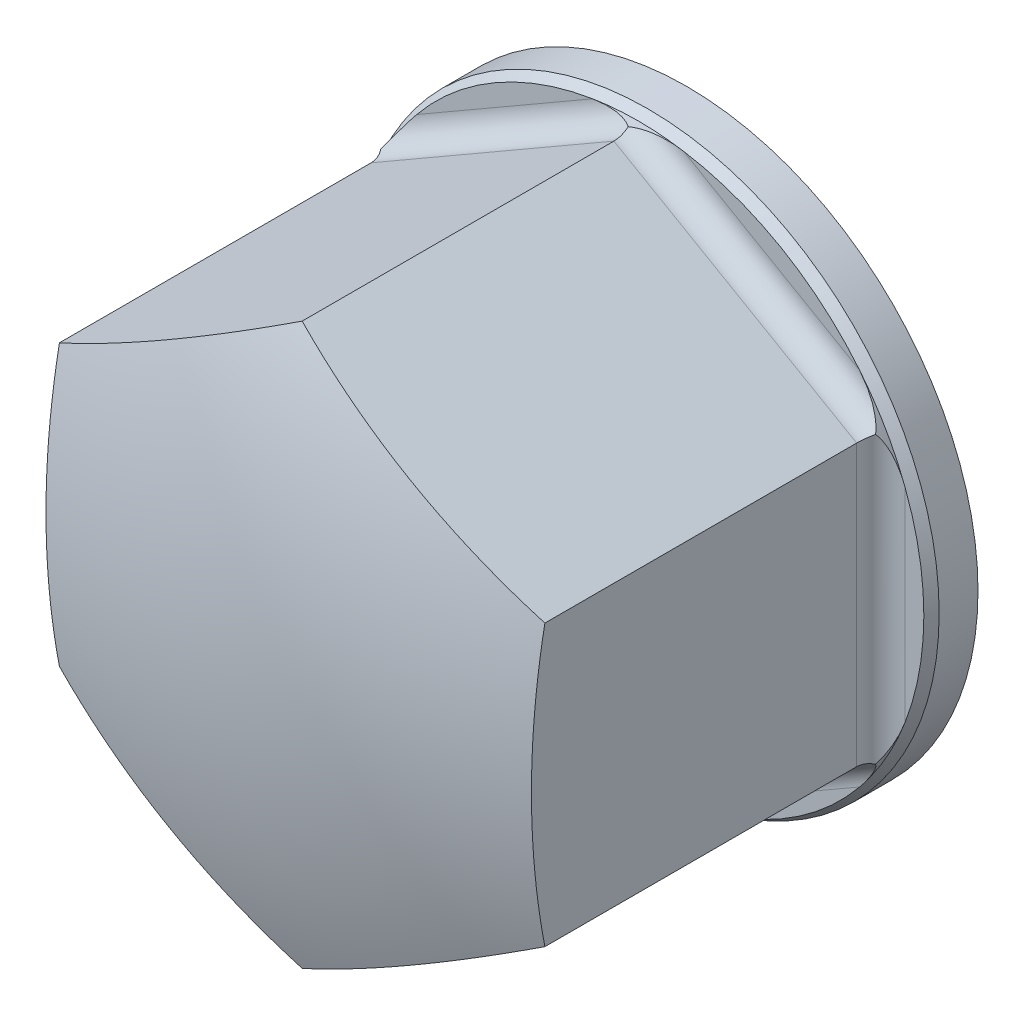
ISO-10303-21;
HEADER;
FILE_DESCRIPTION(('STEP AP214'),'2;1');
FILE_NAME('part.step','',(''),(''),'','','');
FILE_SCHEMA(('AUTOMOTIVE_DESIGN { 1 0 10303 214 1 1 1 1 }'));
ENDSEC;
DATA;
#1=APPLICATION_CONTEXT('core data for automotive mechanical design processes');
#2=APPLICATION_PROTOCOL_DEFINITION('international standard','automotive_design',2000,#1);
#3=PRODUCT_CONTEXT('',#1,'mechanical');
#4=PRODUCT('Part','Part','',(#3));
#5=PRODUCT_RELATED_PRODUCT_CATEGORY('part','',(#4));
#6=PRODUCT_DEFINITION_FORMATION('','',#4);
#7=PRODUCT_DEFINITION_CONTEXT('part definition',#1,'design');
#8=PRODUCT_DEFINITION('design','',#6,#7);
#9=PRODUCT_DEFINITION_SHAPE('','',#8);
#10=(LENGTH_UNIT() NAMED_UNIT(*) SI_UNIT(.MILLI.,.METRE.));
#11=(NAMED_UNIT(*) PLANE_ANGLE_UNIT() SI_UNIT($,.RADIAN.));
#12=(NAMED_UNIT(*) SI_UNIT($,.STERADIAN.) SOLID_ANGLE_UNIT());
#13=UNCERTAINTY_MEASURE_WITH_UNIT(LENGTH_MEASURE(1.E-05),#10,'distance_accuracy_value','');
#14=(GEOMETRIC_REPRESENTATION_CONTEXT(3) GLOBAL_UNCERTAINTY_ASSIGNED_CONTEXT((#13)) GLOBAL_UNIT_ASSIGNED_CONTEXT((#10,
#11,#12)) REPRESENTATION_CONTEXT('',''));
#15=CARTESIAN_POINT('',(0.,0.,0.));
#16=DIRECTION('',(0.,0.,1.));
#17=DIRECTION('',(1.,0.,0.));
#18=AXIS2_PLACEMENT_3D('',#15,#16,#17);
#19=CARTESIAN_POINT('',(0.,0.,0.));
#20=DIRECTION('',(0.,0.,-1.));
#21=DIRECTION('',(1.,0.,0.));
#22=AXIS2_PLACEMENT_3D('',#19,#20,#21);
#23=CYLINDRICAL_SURFACE('',#22,6.);
#24=CARTESIAN_POINT('',(0.,0.,0.));
#25=DIRECTION('',(0.,0.,-1.));
#26=DIRECTION('',(1.,0.,0.));
#27=AXIS2_PLACEMENT_3D('',#24,#25,#26);
#28=CIRCLE('',#27,6.);
#29=CARTESIAN_POINT('',(6.00000000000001,0.,0.));
#30=VERTEX_POINT('',#29);
#31=EDGE_CURVE('E177',#30,#30,#28,.T.);
#32=ORIENTED_EDGE('',*,*,#31,.F.);
#33=EDGE_LOOP('',(#32));
#34=FACE_BOUND('',#33,.T.);
#35=CARTESIAN_POINT('',(0.,0.,0.8));
#36=DIRECTION('',(0.,0.,-1.));
#37=DIRECTION('',(0.,1.,0.));
#38=AXIS2_PLACEMENT_3D('',#35,#36,#37);
#39=CIRCLE('',#38,6.);
#40=CARTESIAN_POINT('',(0.,6.,0.8));
#41=VERTEX_POINT('',#40);
#42=EDGE_CURVE('E138',#41,#41,#39,.T.);
#43=ORIENTED_EDGE('',*,*,#42,.T.);
#44=EDGE_LOOP('',(#43));
#45=FACE_BOUND('',#44,.T.);
#46=ADVANCED_FACE('F14',(#34,#45),#23,.T.);
#47=CARTESIAN_POINT('',(6.,0.,0.));
#48=DIRECTION('',(0.,0.,1.));
#49=DIRECTION('',(-1.,0.,0.));
#50=AXIS2_PLACEMENT_3D('',#47,#48,#49);
#51=PLANE('',#50);
#52=CARTESIAN_POINT('',(0.,0.,0.));
#53=DIRECTION('',(0.,0.,-1.));
#54=DIRECTION('',(1.,0.,0.));
#55=AXIS2_PLACEMENT_3D('',#52,#53,#54);
#56=CIRCLE('',#55,3.);
#57=CARTESIAN_POINT('',(3.00000000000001,0.,0.));
#58=VERTEX_POINT('',#57);
#59=EDGE_CURVE('E333',#58,#58,#56,.T.);
#60=ORIENTED_EDGE('',*,*,#59,.F.);
#61=EDGE_LOOP('',(#60));
#62=FACE_BOUND('',#61,.T.);
#63=ORIENTED_EDGE('',*,*,#31,.T.);
#64=EDGE_LOOP('',(#63));
#65=FACE_BOUND('',#64,.T.);
#66=ADVANCED_FACE('F317',(#62,#65),#51,.F.);
#67=CARTESIAN_POINT('',(0.,0.,0.8));
#68=DIRECTION('',(0.,0.,-1.));
#69=DIRECTION('',(0.,1.,0.));
#70=AXIS2_PLACEMENT_3D('',#67,#68,#69);
#71=CYLINDRICAL_SURFACE('',#70,5.88452994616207);
#72=CARTESIAN_POINT('',(-5.0408726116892,-3.036,1.30200494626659));
#73=CARTESIAN_POINT('',(-5.04670550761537,-3.02631681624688,1.28849453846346));
#74=CARTESIAN_POINT('',(-5.05292061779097,-3.01593273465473,1.27570518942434));
#75=CARTESIAN_POINT('',(-5.06590787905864,-2.99406565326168,1.25149804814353));
#76=CARTESIAN_POINT('',(-5.072678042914,-2.98258655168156,1.24007569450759));
#77=CARTESIAN_POINT('',(-5.09333845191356,-2.94725773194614,1.20799355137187));
#78=CARTESIAN_POINT('',(-5.10779048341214,-2.92216747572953,1.18906620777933));
#79=CARTESIAN_POINT('',(-5.13464017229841,-2.87467756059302,1.1581659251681));
#80=CARTESIAN_POINT('',(-5.14693463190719,-2.85261605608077,1.14555427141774));
#81=CARTESIAN_POINT('',(-5.17169935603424,-2.80746904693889,1.12250286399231));
#82=CARTESIAN_POINT('',(-5.18416971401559,-2.784382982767,1.11206431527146));
#83=CARTESIAN_POINT('',(-5.22196958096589,-2.71323254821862,1.08320089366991));
#84=CARTESIAN_POINT('',(-5.24728112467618,-2.66399076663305,1.06765920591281));
#85=CARTESIAN_POINT('',(-5.29328138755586,-2.57121479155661,1.04411992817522));
#86=CARTESIAN_POINT('',(-5.31409652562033,-2.52792473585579,1.03534287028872));
#87=CARTESIAN_POINT('',(-5.3548722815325,-2.44036222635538,1.02103731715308));
#88=CARTESIAN_POINT('',(-5.37483196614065,-2.39608877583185,1.01551229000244));
#89=CARTESIAN_POINT('',(-5.41289974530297,-2.30876185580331,1.00727593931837));
#90=CARTESIAN_POINT('',(-5.43105048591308,-2.26573659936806,1.00445492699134));
#91=CARTESIAN_POINT('',(-5.46630824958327,-2.17929920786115,1.00082662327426));
#92=CARTESIAN_POINT('',(-5.48341777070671,-2.13588831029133,1.00001431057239));
#93=CARTESIAN_POINT('',(-5.5,-2.0922936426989,1.));
#94=B_SPLINE_CURVE_WITH_KNOTS('',3,(#72,#73,#74,#75,#76,#77,#78,#79,#80,#81,#82,#83,#84,#85,#86,
#87,#88,#89,#90,#91,#92,#93),.UNSPECIFIED.,.F.,.F.,(4,2,2,2,2,2,2,2,2,2,4),(0.,
0.052752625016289,0.105324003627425,0.208666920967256,0.293253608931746,0.377887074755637,
0.549910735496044,0.696276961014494,0.842798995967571,0.983088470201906,1.12302689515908),.UNSPECIFIED.);
#95=CARTESIAN_POINT('',(-5.09615242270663,-2.94226497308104,1.20519984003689));
#96=VERTEX_POINT('',#95);
#97=CARTESIAN_POINT('',(-5.5,-2.0922936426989,1.));
#98=VERTEX_POINT('',#97);
#99=EDGE_CURVE('E272',#96,#98,#94,.T.);
#100=ORIENTED_EDGE('',*,*,#99,.T.);
#101=CARTESIAN_POINT('',(0.,0.,1.));
#102=DIRECTION('',(0.,0.,-1.));
#103=DIRECTION('',(0.,1.,0.));
#104=AXIS2_PLACEMENT_3D('',#101,#102,#103);
#105=CIRCLE('',#104,5.88452994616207);
#106=CARTESIAN_POINT('',(-4.56197944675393,-3.71699289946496,1.));
#107=VERTEX_POINT('',#106);
#108=EDGE_CURVE('E574',#107,#98,#105,.T.);
#109=ORIENTED_EDGE('',*,*,#108,.F.);
#110=CARTESIAN_POINT('',(-4.56197944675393,-3.71699289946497,1.));
#111=CARTESIAN_POINT('',(-4.59415609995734,-3.67750631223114,1.00002128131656));
#112=CARTESIAN_POINT('',(-4.62583189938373,-3.63757788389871,1.0009866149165));
#113=CARTESIAN_POINT('',(-4.68819152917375,-3.55684622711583,1.00535418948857));
#114=CARTESIAN_POINT('',(-4.71887111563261,-3.51604024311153,1.00876571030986));
#115=CARTESIAN_POINT('',(-4.78026933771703,-3.43213261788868,1.01878968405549));
#116=CARTESIAN_POINT('',(-4.81093501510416,-3.38900675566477,1.02553110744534));
#117=CARTESIAN_POINT('',(-4.87067859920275,-3.3025647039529,1.04311775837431));
#118=CARTESIAN_POINT('',(-4.89975911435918,-3.25924896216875,1.05395599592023));
#119=CARTESIAN_POINT('',(-4.95206170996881,-3.17910874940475,1.07903562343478));
#120=CARTESIAN_POINT('',(-4.97553073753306,-3.14223246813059,1.09257910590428));
#121=CARTESIAN_POINT('',(-5.02041285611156,-3.07000407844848,1.124462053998));
#122=CARTESIAN_POINT('',(-5.04184914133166,-3.03463822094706,1.14273533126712));
#123=CARTESIAN_POINT('',(-5.0787570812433,-2.97237024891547,1.18187052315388));
#124=CARTESIAN_POINT('',(-5.09461362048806,-2.94507622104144,1.20170581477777));
#125=CARTESIAN_POINT('',(-5.11672737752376,-2.90637598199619,1.23567469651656));
#126=CARTESIAN_POINT('',(-5.12387456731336,-2.89374999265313,1.24782456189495));
#127=CARTESIAN_POINT('',(-5.13740684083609,-2.86965825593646,1.27370075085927));
#128=CARTESIAN_POINT('',(-5.14378884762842,-2.85819721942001,1.28743303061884));
#129=CARTESIAN_POINT('',(-5.14968943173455,-2.8475237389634,1.30200494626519));
#130=B_SPLINE_CURVE_WITH_KNOTS('',3,(#110,#111,#112,#113,#114,#115,#116,#117,#118,#119,#120,
#121,#122,#123,#124,#125,#126,#127,#128,#129),.UNSPECIFIED.,.F.,.F.,(4,2,2,2,2,2,2,2,2,4),(0.,
0.152836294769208,0.306255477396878,0.466147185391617,0.625767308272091,0.762817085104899,
0.898043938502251,1.0093961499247,1.06606352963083,1.12295163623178),.UNSPECIFIED.);
#131=EDGE_CURVE('E267',#107,#96,#130,.T.);
#132=ORIENTED_EDGE('',*,*,#131,.T.);
#133=EDGE_LOOP('',(#100,#109,#132));
#134=FACE_BOUND('',#133,.T.);
#135=ADVANCED_FACE('F202',(#134),#71,.T.);
#136=CARTESIAN_POINT('',(5.04087261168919,3.036,1.30200494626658));
#137=CARTESIAN_POINT('',(5.04670550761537,3.02631681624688,1.28849453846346));
#138=CARTESIAN_POINT('',(5.05292061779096,3.01593273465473,1.27570518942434));
#139=CARTESIAN_POINT('',(5.06590787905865,2.99406565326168,1.25149804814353));
#140=CARTESIAN_POINT('',(5.072678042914,2.98258655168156,1.24007569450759));
#141=CARTESIAN_POINT('',(5.09333845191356,2.94725773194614,1.20799355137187));
#142=CARTESIAN_POINT('',(5.10779048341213,2.92216747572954,1.18906620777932));
#143=CARTESIAN_POINT('',(5.1346401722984,2.87467756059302,1.1581659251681));
#144=CARTESIAN_POINT('',(5.14693463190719,2.85261605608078,1.14555427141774));
#145=CARTESIAN_POINT('',(5.17169935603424,2.80746904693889,1.12250286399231));
#146=CARTESIAN_POINT('',(5.18416971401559,2.784382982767,1.11206431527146));
#147=CARTESIAN_POINT('',(5.22196958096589,2.71323254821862,1.08320089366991));
#148=CARTESIAN_POINT('',(5.24728112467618,2.66399076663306,1.0676592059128));
#149=CARTESIAN_POINT('',(5.29328138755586,2.57121479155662,1.04411992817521));
#150=CARTESIAN_POINT('',(5.31409652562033,2.52792473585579,1.03534287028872));
#151=CARTESIAN_POINT('',(5.35487228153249,2.44036222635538,1.02103731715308));
#152=CARTESIAN_POINT('',(5.37483196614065,2.39608877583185,1.01551229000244));
#153=CARTESIAN_POINT('',(5.41289974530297,2.30876185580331,1.00727593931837));
#154=CARTESIAN_POINT('',(5.43105048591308,2.26573659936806,1.00445492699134));
#155=CARTESIAN_POINT('',(5.46630824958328,2.17929920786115,1.00082662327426));
#156=CARTESIAN_POINT('',(5.48341777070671,2.13588831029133,1.00001431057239));
#157=CARTESIAN_POINT('',(5.5,2.0922936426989,1.));
#158=B_SPLINE_CURVE_WITH_KNOTS('',3,(#136,#137,#138,#139,#140,#141,#142,#143,#144,#145,#146,
#147,#148,#149,#150,#151,#152,#153,#154,#155,#156,#157),.UNSPECIFIED.,.F.,.F.,(4,2,2,2,2,2,2,2,
2,2,4),(0.,0.0527526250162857,0.105324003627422,0.208666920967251,0.293253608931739,
0.377887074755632,0.549910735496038,0.696276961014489,0.842798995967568,0.983088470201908,
1.12302689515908),.UNSPECIFIED.);
#159=CARTESIAN_POINT('',(5.09615242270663,2.94226497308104,1.20519984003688));
#160=VERTEX_POINT('',#159);
#161=CARTESIAN_POINT('',(5.5,2.0922936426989,1.));
#162=VERTEX_POINT('',#161);
#163=EDGE_CURVE('E261',#160,#162,#158,.T.);
#164=ORIENTED_EDGE('',*,*,#163,.T.);
#165=CARTESIAN_POINT('',(4.56197944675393,3.71699289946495,1.));
#166=VERTEX_POINT('',#165);
#167=EDGE_CURVE('E134',#166,#162,#105,.T.);
#168=ORIENTED_EDGE('',*,*,#167,.F.);
#169=CARTESIAN_POINT('',(4.56197944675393,3.71699289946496,1.));
#170=CARTESIAN_POINT('',(4.59415609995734,3.67750631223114,1.00002128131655));
#171=CARTESIAN_POINT('',(4.62583189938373,3.63757788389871,1.0009866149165));
#172=CARTESIAN_POINT('',(4.68819152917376,3.55684622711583,1.00535418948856));
#173=CARTESIAN_POINT('',(4.71887111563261,3.51604024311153,1.00876571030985));
#174=CARTESIAN_POINT('',(4.78026933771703,3.43213261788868,1.01878968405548));
#175=CARTESIAN_POINT('',(4.81093501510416,3.38900675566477,1.02553110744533));
#176=CARTESIAN_POINT('',(4.87067859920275,3.3025647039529,1.0431177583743));
#177=CARTESIAN_POINT('',(4.89975911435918,3.25924896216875,1.05395599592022));
#178=CARTESIAN_POINT('',(4.95206170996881,3.17910874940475,1.07903562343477));
#179=CARTESIAN_POINT('',(4.97553073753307,3.14223246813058,1.09257910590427));
#180=CARTESIAN_POINT('',(5.02041285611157,3.07000407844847,1.12446205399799));
#181=CARTESIAN_POINT('',(5.04184914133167,3.03463822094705,1.14273533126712));
#182=CARTESIAN_POINT('',(5.07875708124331,2.97237024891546,1.18187052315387));
#183=CARTESIAN_POINT('',(5.09461362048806,2.94507622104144,1.20170581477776));
#184=CARTESIAN_POINT('',(5.11672737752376,2.90637598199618,1.23567469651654));
#185=CARTESIAN_POINT('',(5.12387456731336,2.89374999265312,1.24782456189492));
#186=CARTESIAN_POINT('',(5.1374068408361,2.86965825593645,1.27370075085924));
#187=CARTESIAN_POINT('',(5.14378884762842,2.85819721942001,1.28743303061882));
#188=CARTESIAN_POINT('',(5.14968943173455,2.8475237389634,1.30200494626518));
#189=B_SPLINE_CURVE_WITH_KNOTS('',3,(#169,#170,#171,#172,#173,#174,#175,#176,#177,#178,#179,
#180,#181,#182,#183,#184,#185,#186,#187,#188),.UNSPECIFIED.,.F.,.F.,(4,2,2,2,2,2,2,2,2,4),(0.,
0.152836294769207,0.306255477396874,0.466147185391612,0.625767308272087,0.762817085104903,
0.898043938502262,1.0093961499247,1.06606352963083,1.12295163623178),.UNSPECIFIED.);
#190=EDGE_CURVE('E255',#166,#160,#189,.T.);
#191=ORIENTED_EDGE('',*,*,#190,.T.);
#192=EDGE_LOOP('',(#164,#168,#191));
#193=FACE_BOUND('',#192,.T.);
#194=ADVANCED_FACE('F484',(#193),#71,.T.);
#195=CARTESIAN_POINT('',(-5.5,2.0922936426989,1.));
#196=CARTESIAN_POINT('',(-5.48189193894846,2.13990273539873,1.00002128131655));
#197=CARTESIAN_POINT('',(-5.46315080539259,2.18729899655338,1.00098661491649));
#198=CARTESIAN_POINT('',(-5.42441495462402,2.28166984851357,1.00535418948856));
#199=CARTESIAN_POINT('',(-5.4044157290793,2.3286421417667,1.00876571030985));
#200=CARTESIAN_POINT('',(-5.3624487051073,2.42376837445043,1.01878968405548));
#201=CARTESIAN_POINT('',(-5.34043345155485,2.47188856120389,1.02553110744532));
#202=CARTESIAN_POINT('',(-5.29544423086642,2.56684904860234,1.04311775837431));
#203=CARTESIAN_POINT('',(-5.27247195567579,2.61369138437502,1.05395599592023));
#204=CARTESIAN_POINT('',(-5.22921979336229,2.69905686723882,1.07903562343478));
#205=CARTESIAN_POINT('',(-5.20901851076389,2.73781978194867,1.09257910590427));
#206=CARTESIAN_POINT('',(-5.16890794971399,2.81280303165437,1.12446205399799));
#207=CARTESIAN_POINT('',(-5.1489983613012,2.84905032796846,1.14273533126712));
#208=CARTESIAN_POINT('',(-5.11352668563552,2.91214752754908,1.18187052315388));
#209=CARTESIAN_POINT('',(-5.09781763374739,2.93952670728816,1.20170581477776));
#210=CARTESIAN_POINT('',(-5.07535912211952,2.97802790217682,1.23567469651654));
#211=CARTESIAN_POINT('',(-5.06799828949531,2.99053054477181,1.24782456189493));
#212=CARTESIAN_POINT('',(-5.05390037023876,3.01429570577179,1.27370075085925));
#213=CARTESIAN_POINT('',(-5.04716582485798,3.02555320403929,1.28743303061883));
#214=CARTESIAN_POINT('',(-5.04087261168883,3.03600000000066,1.30200494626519));
#215=B_SPLINE_CURVE_WITH_KNOTS('',3,(#195,#196,#197,#198,#199,#200,#201,#202,#203,#204,#205,
#206,#207,#208,#209,#210,#211,#212,#213,#214),.UNSPECIFIED.,.F.,.F.,(4,2,2,2,2,2,2,2,2,4),(0.,
0.152836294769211,0.306255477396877,0.466147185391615,0.625767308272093,0.762817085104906,
0.898043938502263,1.00939614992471,1.06606352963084,1.12295163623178),.UNSPECIFIED.);
#216=CARTESIAN_POINT('',(-5.5,2.0922936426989,1.));
#217=VERTEX_POINT('',#216);
#218=CARTESIAN_POINT('',(-5.09615242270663,2.94226497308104,1.20519984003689));
#219=VERTEX_POINT('',#218);
#220=EDGE_CURVE('E247',#217,#219,#215,.T.);
#221=ORIENTED_EDGE('',*,*,#220,.T.);
#222=CARTESIAN_POINT('',(-5.14968943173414,2.84752373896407,1.30200494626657));
#223=CARTESIAN_POINT('',(-5.14421999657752,2.85741676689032,1.28849453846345));
#224=CARTESIAN_POINT('',(-5.13833467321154,2.86799125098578,1.27570518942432));
#225=CARTESIAN_POINT('',(-5.12589085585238,2.8901720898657,1.2514980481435));
#226=CARTESIAN_POINT('',(-5.11933474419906,2.90177477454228,1.24007569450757));
#227=CARTESIAN_POINT('',(-5.09906929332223,2.9373316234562,1.20799355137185));
#228=CARTESIAN_POINT('',(-5.08456650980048,2.96239257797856,1.18906620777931));
#229=CARTESIAN_POINT('',(-5.05686388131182,3.00939004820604,1.15816592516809));
#230=CARTESIAN_POINT('',(-5.0439052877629,3.03106811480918,1.14555427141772));
#231=CARTESIAN_POINT('',(-5.01718919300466,3.07508849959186,1.12250286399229));
#232=CARTESIAN_POINT('',(-5.00343125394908,3.09743117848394,1.11206431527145));
#233=CARTESIAN_POINT('',(-4.96071310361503,3.16574204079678,1.0832008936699));
#234=CARTESIAN_POINT('',(-4.93072424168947,3.21228337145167,1.06765920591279));
#235=CARTESIAN_POINT('',(-4.87337802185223,3.29850875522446,1.04411992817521));
#236=CARTESIAN_POINT('',(-4.84629530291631,3.33818022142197,1.03534287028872));
#237=CARTESIAN_POINT('',(-4.79085182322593,3.41727431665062,1.02103731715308));
#238=CARTESIAN_POINT('',(-4.76248973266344,3.45669663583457,1.01551229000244));
#239=CARTESIAN_POINT('',(-4.70589629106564,3.53332775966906,1.00727593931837));
#240=CARTESIAN_POINT('',(-4.67771069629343,3.57055939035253,1.00445492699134));
#241=CARTESIAN_POINT('',(-4.62048260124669,3.644312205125,1.00082662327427));
#242=CARTESIAN_POINT('',(-4.59144242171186,3.68083493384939,1.0000143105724));
#243=CARTESIAN_POINT('',(-4.56197944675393,3.71699289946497,1.));
#244=B_SPLINE_CURVE_WITH_KNOTS('',3,(#222,#223,#224,#225,#226,#227,#228,#229,#230,#231,#232,
#233,#234,#235,#236,#237,#238,#239,#240,#241,#242,#243),.UNSPECIFIED.,.F.,.F.,(4,2,2,2,2,2,2,2,
2,2,4),(0.,0.0527526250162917,0.10532400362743,0.208666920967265,0.293253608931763,
0.377887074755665,0.549910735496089,0.696276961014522,0.842798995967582,0.983088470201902,
1.12302689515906),.UNSPECIFIED.);
#245=CARTESIAN_POINT('',(-4.56197944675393,3.71699289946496,1.));
#246=VERTEX_POINT('',#245);
#247=EDGE_CURVE('E240',#219,#246,#244,.T.);
#248=ORIENTED_EDGE('',*,*,#247,.T.);
#249=EDGE_CURVE('E587',#217,#246,#105,.T.);
#250=ORIENTED_EDGE('',*,*,#249,.F.);
#251=EDGE_LOOP('',(#221,#248,#250));
#252=FACE_BOUND('',#251,.T.);
#253=ADVANCED_FACE('F477',(#252),#71,.T.);
#254=CARTESIAN_POINT('',(-0.108816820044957,5.88352373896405,1.30200494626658));
#255=CARTESIAN_POINT('',(-0.0975144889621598,5.88373358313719,1.28849453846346));
#256=CARTESIAN_POINT('',(-0.0854140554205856,5.8839239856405,1.27570518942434));
#257=CARTESIAN_POINT('',(-0.0599829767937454,5.88423774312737,1.25149804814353));
#258=CARTESIAN_POINT('',(-0.0466567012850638,5.88436132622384,1.24007569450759));
#259=CARTESIAN_POINT('',(-0.00573084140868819,5.88458935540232,1.20799355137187));
#260=CARTESIAN_POINT('',(0.0232239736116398,5.88456005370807,1.18906620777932));
#261=CARTESIAN_POINT('',(0.0777762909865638,5.88406760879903,1.1581659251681));
#262=CARTESIAN_POINT('',(0.103029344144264,5.88368417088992,1.14555427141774));
#263=CARTESIAN_POINT('',(0.154510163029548,5.88255754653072,1.12250286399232));
#264=CARTESIAN_POINT('',(0.180738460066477,5.88181416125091,1.11206431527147));
#265=CARTESIAN_POINT('',(0.261256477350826,5.87897458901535,1.08320089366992));
#266=CARTESIAN_POINT('',(0.31655688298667,5.87627413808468,1.06765920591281));
#267=CARTESIAN_POINT('',(0.419903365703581,5.86972354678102,1.04411992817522));
#268=CARTESIAN_POINT('',(0.467801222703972,5.86610495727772,1.03534287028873));
#269=CARTESIAN_POINT('',(0.56402045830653,5.85763654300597,1.02103731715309));
#270=CARTESIAN_POINT('',(0.612342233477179,5.85278541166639,1.01551229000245));
#271=CARTESIAN_POINT('',(0.70700345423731,5.84208961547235,1.00727593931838));
#272=CARTESIAN_POINT('',(0.753339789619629,5.83629598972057,1.00445492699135));
#273=CARTESIAN_POINT('',(0.845825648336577,5.82361141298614,1.00082662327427));
#274=CARTESIAN_POINT('',(0.891975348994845,5.81672324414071,1.0000143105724));
#275=CARTESIAN_POINT('',(0.938020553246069,5.80928654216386,1.));
#276=B_SPLINE_CURVE_WITH_KNOTS('',3,(#254,#255,#256,#257,#258,#259,#260,#261,#262,#263,#264,
#265,#266,#267,#268,#269,#270,#271,#272,#273,#274,#275),.UNSPECIFIED.,.F.,.F.,(4,2,2,2,2,2,2,2,
2,2,4),(0.,0.052752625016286,0.105324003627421,0.208666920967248,0.293253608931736,
0.377887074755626,0.549910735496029,0.696276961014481,0.842798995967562,0.983088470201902,
1.12302689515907),.UNSPECIFIED.);
#277=CARTESIAN_POINT('',(0.,5.88452994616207,1.20519984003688));
#278=VERTEX_POINT('',#277);
#279=CARTESIAN_POINT('',(0.938020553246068,5.80928654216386,1.));
#280=VERTEX_POINT('',#279);
#281=EDGE_CURVE('E232',#278,#280,#276,.T.);
#282=ORIENTED_EDGE('',*,*,#281,.T.);
#283=CARTESIAN_POINT('',(-0.938020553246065,5.80928654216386,1.));
#284=VERTEX_POINT('',#283);
#285=EDGE_CURVE('E594',#284,#280,#105,.T.);
#286=ORIENTED_EDGE('',*,*,#285,.F.);
#287=CARTESIAN_POINT('',(-0.938020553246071,5.80928654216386,1.));
#288=CARTESIAN_POINT('',(-0.887735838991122,5.81740904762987,1.00002128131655));
#289=CARTESIAN_POINT('',(-0.837318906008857,5.82487688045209,1.0009866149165));
#290=CARTESIAN_POINT('',(-0.736223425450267,5.83851607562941,1.00535418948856));
#291=CARTESIAN_POINT('',(-0.685544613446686,5.84468238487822,1.00876571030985));
#292=CARTESIAN_POINT('',(-0.582179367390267,5.85590099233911,1.01878968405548));
#293=CARTESIAN_POINT('',(-0.529498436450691,5.86089531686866,1.02553110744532));
#294=CARTESIAN_POINT('',(-0.424765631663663,5.86941375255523,1.04311775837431));
#295=CARTESIAN_POINT('',(-0.372712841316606,5.87294034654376,1.05395599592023));
#296=CARTESIAN_POINT('',(-0.277158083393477,5.87816561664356,1.07903562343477));
#297=CARTESIAN_POINT('',(-0.233487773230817,5.88005225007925,1.09257910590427));
#298=CARTESIAN_POINT('',(-0.148495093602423,5.88280711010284,1.12446205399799));
#299=CARTESIAN_POINT('',(-0.107149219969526,5.88368854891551,1.14273533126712));
#300=CARTESIAN_POINT('',(-0.0347696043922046,5.88451777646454,1.18187052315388));
#301=CARTESIAN_POINT('',(-0.003204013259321,5.88460292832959,1.20170581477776));
#302=CARTESIAN_POINT('',(0.0413682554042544,5.884403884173,1.23567469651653));
#303=CARTESIAN_POINT('',(0.0558762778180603,5.88428053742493,1.24782456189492));
#304=CARTESIAN_POINT('',(0.0835064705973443,5.88395396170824,1.27370075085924));
#305=CARTESIAN_POINT('',(0.0966230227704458,5.8837504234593,1.28743303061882));
#306=CARTESIAN_POINT('',(0.108816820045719,5.88352373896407,1.30200494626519));
#307=B_SPLINE_CURVE_WITH_KNOTS('',3,(#287,#288,#289,#290,#291,#292,#293,#294,#295,#296,#297,
#298,#299,#300,#301,#302,#303,#304,#305,#306),.UNSPECIFIED.,.F.,.F.,(4,2,2,2,2,2,2,2,2,4),(0.,
0.152836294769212,0.306255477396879,0.466147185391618,0.625767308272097,0.76281708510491,
0.898043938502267,1.00939614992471,1.06606352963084,1.12295163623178),.UNSPECIFIED.);
#308=EDGE_CURVE('E153',#284,#278,#307,.T.);
#309=ORIENTED_EDGE('',*,*,#308,.T.);
#310=EDGE_LOOP('',(#282,#286,#309));
#311=FACE_BOUND('',#310,.T.);
#312=ADVANCED_FACE('F471',(#311),#71,.T.);
#313=CARTESIAN_POINT('',(5.5,-2.0922936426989,1.));
#314=CARTESIAN_POINT('',(5.48189193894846,-2.13990273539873,1.00002128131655));
#315=CARTESIAN_POINT('',(5.46315080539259,-2.18729899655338,1.00098661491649));
#316=CARTESIAN_POINT('',(5.42441495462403,-2.28166984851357,1.00535418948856));
#317=CARTESIAN_POINT('',(5.4044157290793,-2.3286421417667,1.00876571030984));
#318=CARTESIAN_POINT('',(5.3624487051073,-2.42376837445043,1.01878968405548));
#319=CARTESIAN_POINT('',(5.34043345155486,-2.47188856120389,1.02553110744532));
#320=CARTESIAN_POINT('',(5.29544423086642,-2.56684904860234,1.0431177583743));
#321=CARTESIAN_POINT('',(5.27247195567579,-2.61369138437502,1.05395599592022));
#322=CARTESIAN_POINT('',(5.22921979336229,-2.69905686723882,1.07903562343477));
#323=CARTESIAN_POINT('',(5.20901851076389,-2.73781978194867,1.09257910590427));
#324=CARTESIAN_POINT('',(5.16890794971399,-2.81280303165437,1.12446205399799));
#325=CARTESIAN_POINT('',(5.1489983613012,-2.84905032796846,1.14273533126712));
#326=CARTESIAN_POINT('',(5.11352668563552,-2.91214752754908,1.18187052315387));
#327=CARTESIAN_POINT('',(5.09781763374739,-2.93952670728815,1.20170581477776));
#328=CARTESIAN_POINT('',(5.07535912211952,-2.97802790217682,1.23567469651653));
#329=CARTESIAN_POINT('',(5.06799828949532,-2.99053054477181,1.24782456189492));
#330=CARTESIAN_POINT('',(5.05390037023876,-3.01429570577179,1.27370075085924));
#331=CARTESIAN_POINT('',(5.04716582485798,-3.02555320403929,1.28743303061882));
#332=CARTESIAN_POINT('',(5.04087261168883,-3.03600000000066,1.30200494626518));
#333=B_SPLINE_CURVE_WITH_KNOTS('',3,(#313,#314,#315,#316,#317,#318,#319,#320,#321,#322,#323,
#324,#325,#326,#327,#328,#329,#330,#331,#332),.UNSPECIFIED.,.F.,.F.,(4,2,2,2,2,2,2,2,2,4),(0.,
0.152836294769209,0.306255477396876,0.466147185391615,0.625767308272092,0.762817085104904,
0.898043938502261,1.0093961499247,1.06606352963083,1.12295163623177),.UNSPECIFIED.);
#334=CARTESIAN_POINT('',(5.5,-2.0922936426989,1.));
#335=VERTEX_POINT('',#334);
#336=CARTESIAN_POINT('',(5.09615242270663,-2.94226497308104,1.20519984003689));
#337=VERTEX_POINT('',#336);
#338=EDGE_CURVE('E143',#335,#337,#333,.T.);
#339=ORIENTED_EDGE('',*,*,#338,.T.);
#340=CARTESIAN_POINT('',(5.14968943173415,-2.84752373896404,1.3020049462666));
#341=CARTESIAN_POINT('',(5.14421999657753,-2.8574167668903,1.28849453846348));
#342=CARTESIAN_POINT('',(5.13833467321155,-2.86799125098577,1.27570518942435));
#343=CARTESIAN_POINT('',(5.1258908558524,-2.89017208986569,1.25149804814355));
#344=CARTESIAN_POINT('',(5.11933474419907,-2.90177477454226,1.24007569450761));
#345=CARTESIAN_POINT('',(5.09906929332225,-2.93733162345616,1.20799355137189));
#346=CARTESIAN_POINT('',(5.08456650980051,-2.96239257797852,1.18906620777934));
#347=CARTESIAN_POINT('',(5.05686388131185,-3.00939004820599,1.15816592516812));
#348=CARTESIAN_POINT('',(5.04390528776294,-3.03106811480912,1.14555427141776));
#349=CARTESIAN_POINT('',(5.0171891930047,-3.0750884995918,1.12250286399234));
#350=CARTESIAN_POINT('',(5.00343125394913,-3.09743117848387,1.11206431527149));
#351=CARTESIAN_POINT('',(4.96071310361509,-3.16574204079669,1.08320089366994));
#352=CARTESIAN_POINT('',(4.93072424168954,-3.21228337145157,1.06765920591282));
#353=CARTESIAN_POINT('',(4.8733780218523,-3.29850875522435,1.04411992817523));
#354=CARTESIAN_POINT('',(4.84629530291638,-3.33818022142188,1.03534287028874));
#355=CARTESIAN_POINT('',(4.79085182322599,-3.41727431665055,1.0210373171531));
#356=CARTESIAN_POINT('',(4.76248973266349,-3.45669663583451,1.01551229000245));
#357=CARTESIAN_POINT('',(4.70589629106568,-3.53332775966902,1.00727593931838));
#358=CARTESIAN_POINT('',(4.67771069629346,-3.5705593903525,1.00445492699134));
#359=CARTESIAN_POINT('',(4.6204826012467,-3.64431220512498,1.00082662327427));
#360=CARTESIAN_POINT('',(4.59144242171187,-3.68083493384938,1.0000143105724));
#361=CARTESIAN_POINT('',(4.56197944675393,-3.71699289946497,1.));
#362=B_SPLINE_CURVE_WITH_KNOTS('',3,(#340,#341,#342,#343,#344,#345,#346,#347,#348,#349,#350,
#351,#352,#353,#354,#355,#356,#357,#358,#359,#360,#361),.UNSPECIFIED.,.F.,.F.,(4,2,2,2,2,2,2,2,
2,2,4),(0.,0.0527526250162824,0.105324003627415,0.208666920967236,0.293253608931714,
0.377887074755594,0.549910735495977,0.696276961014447,0.842798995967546,0.983088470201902,
1.12302689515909),.UNSPECIFIED.);
#363=CARTESIAN_POINT('',(4.56197944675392,-3.71699289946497,1.));
#364=VERTEX_POINT('',#363);
#365=EDGE_CURVE('E9',#337,#364,#362,.T.);
#366=ORIENTED_EDGE('',*,*,#365,.T.);
#367=EDGE_CURVE('E132',#335,#364,#105,.T.);
#368=ORIENTED_EDGE('',*,*,#367,.F.);
#369=EDGE_LOOP('',(#339,#366,#368));
#370=FACE_BOUND('',#369,.T.);
#371=ADVANCED_FACE('F142',(#370),#71,.T.);
#372=CARTESIAN_POINT('',(0.108816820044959,-5.88352373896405,1.30200494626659));
#373=CARTESIAN_POINT('',(0.0975144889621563,-5.88373358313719,1.28849453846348));
#374=CARTESIAN_POINT('',(0.0854140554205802,-5.8839239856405,1.27570518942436));
#375=CARTESIAN_POINT('',(0.0599829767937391,-5.88423774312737,1.25149804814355));
#376=CARTESIAN_POINT('',(0.0466567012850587,-5.88436132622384,1.24007569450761));
#377=CARTESIAN_POINT('',(0.0057308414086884,-5.88458935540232,1.20799355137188));
#378=CARTESIAN_POINT('',(-0.0232239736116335,-5.88456005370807,1.18906620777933));
#379=CARTESIAN_POINT('',(-0.0777762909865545,-5.88406760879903,1.15816592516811));
#380=CARTESIAN_POINT('',(-0.103029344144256,-5.88368417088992,1.14555427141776));
#381=CARTESIAN_POINT('',(-0.15451016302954,-5.88255754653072,1.12250286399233));
#382=CARTESIAN_POINT('',(-0.180738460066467,-5.88181416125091,1.11206431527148));
#383=CARTESIAN_POINT('',(-0.26125647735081,-5.87897458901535,1.08320089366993));
#384=CARTESIAN_POINT('',(-0.316556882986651,-5.87627413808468,1.06765920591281));
#385=CARTESIAN_POINT('',(-0.419903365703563,-5.86972354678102,1.04411992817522));
#386=CARTESIAN_POINT('',(-0.467801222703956,-5.86610495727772,1.03534287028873));
#387=CARTESIAN_POINT('',(-0.56402045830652,-5.85763654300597,1.0210373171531));
#388=CARTESIAN_POINT('',(-0.612342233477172,-5.85278541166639,1.01551229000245));
#389=CARTESIAN_POINT('',(-0.707003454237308,-5.84208961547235,1.00727593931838));
#390=CARTESIAN_POINT('',(-0.753339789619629,-5.83629598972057,1.00445492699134));
#391=CARTESIAN_POINT('',(-0.845825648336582,-5.82361141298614,1.00082662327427));
#392=CARTESIAN_POINT('',(-0.891975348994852,-5.81672324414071,1.0000143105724));
#393=CARTESIAN_POINT('',(-0.938020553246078,-5.80928654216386,1.));
#394=B_SPLINE_CURVE_WITH_KNOTS('',3,(#372,#373,#374,#375,#376,#377,#378,#379,#380,#381,#382,
#383,#384,#385,#386,#387,#388,#389,#390,#391,#392,#393),.UNSPECIFIED.,.F.,.F.,(4,2,2,2,2,2,2,2,
2,2,4),(0.,0.0527526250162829,0.105324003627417,0.208666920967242,0.293253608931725,
0.377887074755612,0.549910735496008,0.696276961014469,0.842798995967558,0.983088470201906,
1.12302689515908),.UNSPECIFIED.);
#395=CARTESIAN_POINT('',(0.,-5.88452994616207,1.20519984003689));
#396=VERTEX_POINT('',#395);
#397=CARTESIAN_POINT('',(-0.938020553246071,-5.80928654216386,1.));
#398=VERTEX_POINT('',#397);
#399=EDGE_CURVE('E145',#396,#398,#394,.T.);
#400=ORIENTED_EDGE('',*,*,#399,.T.);
#401=CARTESIAN_POINT('',(0.938020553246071,-5.80928654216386,1.));
#402=VERTEX_POINT('',#401);
#403=EDGE_CURVE('E664',#402,#398,#105,.T.);
#404=ORIENTED_EDGE('',*,*,#403,.F.);
#405=CARTESIAN_POINT('',(0.938020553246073,-5.80928654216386,1.));
#406=CARTESIAN_POINT('',(0.887735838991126,-5.81740904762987,1.00002128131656));
#407=CARTESIAN_POINT('',(0.837318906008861,-5.82487688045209,1.0009866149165));
#408=CARTESIAN_POINT('',(0.736223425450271,-5.83851607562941,1.00535418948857));
#409=CARTESIAN_POINT('',(0.68554461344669,-5.84468238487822,1.00876571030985));
#410=CARTESIAN_POINT('',(0.58217936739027,-5.85590099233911,1.01878968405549));
#411=CARTESIAN_POINT('',(0.529498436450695,-5.86089531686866,1.02553110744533));
#412=CARTESIAN_POINT('',(0.424765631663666,-5.86941375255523,1.04311775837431));
#413=CARTESIAN_POINT('',(0.372712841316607,-5.87294034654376,1.05395599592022));
#414=CARTESIAN_POINT('',(0.27715808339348,-5.87816561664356,1.07903562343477));
#415=CARTESIAN_POINT('',(0.233487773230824,-5.88005225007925,1.09257910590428));
#416=CARTESIAN_POINT('',(0.148495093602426,-5.88280711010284,1.124462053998));
#417=CARTESIAN_POINT('',(0.107149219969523,-5.88368854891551,1.14273533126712));
#418=CARTESIAN_POINT('',(0.0347696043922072,-5.88451777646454,1.18187052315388));
#419=CARTESIAN_POINT('',(0.00320401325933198,-5.88460292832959,1.20170581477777));
#420=CARTESIAN_POINT('',(-0.0413682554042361,-5.884403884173,1.23567469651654));
#421=CARTESIAN_POINT('',(-0.0558762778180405,-5.88428053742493,1.24782456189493));
#422=CARTESIAN_POINT('',(-0.0835064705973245,-5.88395396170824,1.27370075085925));
#423=CARTESIAN_POINT('',(-0.0966230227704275,-5.8837504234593,1.28743303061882));
#424=CARTESIAN_POINT('',(-0.108816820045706,-5.88352373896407,1.30200494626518));
#425=B_SPLINE_CURVE_WITH_KNOTS('',3,(#405,#406,#407,#408,#409,#410,#411,#412,#413,#414,#415,
#416,#417,#418,#419,#420,#421,#422,#423,#424),.UNSPECIFIED.,.F.,.F.,(4,2,2,2,2,2,2,2,2,4),(0.,
0.152836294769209,0.306255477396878,0.466147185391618,0.625767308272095,0.76281708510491,
0.898043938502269,1.0093961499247,1.06606352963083,1.12295163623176),.UNSPECIFIED.);
#426=EDGE_CURVE('E28',#402,#396,#425,.T.);
#427=ORIENTED_EDGE('',*,*,#426,.T.);
#428=EDGE_LOOP('',(#400,#404,#427));
#429=FACE_BOUND('',#428,.T.);
#430=ADVANCED_FACE('F196',(#429),#71,.T.);
#431=CARTESIAN_POINT('',(0.,0.,1.));
#432=DIRECTION('',(0.,0.,-1.));
#433=DIRECTION('',(0.,1.,0.));
#434=AXIS2_PLACEMENT_3D('',#431,#432,#433);
#435=CONICAL_SURFACE('',#434,5.88452994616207,0.523598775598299);
#436=ORIENTED_EDGE('',*,*,#42,.F.);
#437=EDGE_LOOP('',(#436));
#438=FACE_BOUND('',#437,.T.);
#439=EDGE_CURVE('E129',#162,#335,#105,.T.);
#440=ORIENTED_EDGE('',*,*,#439,.T.);
#441=ORIENTED_EDGE('',*,*,#367,.T.);
#442=EDGE_CURVE('E35',#364,#402,#105,.T.);
#443=ORIENTED_EDGE('',*,*,#442,.T.);
#444=ORIENTED_EDGE('',*,*,#403,.T.);
#445=EDGE_CURVE('E586',#398,#107,#105,.T.);
#446=ORIENTED_EDGE('',*,*,#445,.T.);
#447=ORIENTED_EDGE('',*,*,#108,.T.);
#448=EDGE_CURVE('E583',#98,#217,#105,.T.);
#449=ORIENTED_EDGE('',*,*,#448,.T.);
#450=ORIENTED_EDGE('',*,*,#249,.T.);
#451=EDGE_CURVE('E653',#246,#284,#105,.T.);
#452=ORIENTED_EDGE('',*,*,#451,.T.);
#453=ORIENTED_EDGE('',*,*,#285,.T.);
#454=EDGE_CURVE('E654',#280,#166,#105,.T.);
#455=ORIENTED_EDGE('',*,*,#454,.T.);
#456=ORIENTED_EDGE('',*,*,#167,.T.);
#457=EDGE_LOOP('',(#440,#441,#443,#444,#446,#447,#449,#450,#452,#453,#455,#456));
#458=FACE_BOUND('',#457,.T.);
#459=ADVANCED_FACE('F131',(#438,#458),#435,.T.);
#460=CARTESIAN_POINT('',(0.,0.,-7.));
#461=DIRECTION('',(0.,0.,-1.));
#462=DIRECTION('',(1.,0.,0.));
#463=AXIS2_PLACEMENT_3D('',#460,#461,#462);
#464=SPHERICAL_SURFACE('',#463,16.);
#465=CARTESIAN_POINT('',(-2.5,-4.3301270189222,-7.));
#466=DIRECTION('',(-0.5,-0.866025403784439,0.));
#467=DIRECTION('',(0.866025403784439,-0.5,0.));
#468=AXIS2_PLACEMENT_3D('',#465,#466,#467);
#469=CIRCLE('',#468,15.1986841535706);
#470=CARTESIAN_POINT('',(-5.,-2.88675134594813,7.92201952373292));
#471=VERTEX_POINT('',#470);
#472=CARTESIAN_POINT('',(0.,-5.77350269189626,7.92201952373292));
#473=VERTEX_POINT('',#472);
#474=EDGE_CURVE('E629',#471,#473,#469,.F.);
#475=ORIENTED_EDGE('',*,*,#474,.T.);
#476=CARTESIAN_POINT('',(2.5,-4.3301270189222,-7.));
#477=DIRECTION('',(0.5,-0.866025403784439,0.));
#478=DIRECTION('',(0.866025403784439,0.5,0.));
#479=AXIS2_PLACEMENT_3D('',#476,#477,#478);
#480=CIRCLE('',#479,15.1986841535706);
#481=CARTESIAN_POINT('',(5.,-2.88675134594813,7.92201952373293));
#482=VERTEX_POINT('',#481);
#483=EDGE_CURVE('E638',#473,#482,#480,.F.);
#484=ORIENTED_EDGE('',*,*,#483,.T.);
#485=CARTESIAN_POINT('',(5.,0.,-7.));
#486=DIRECTION('',(1.,0.,0.));
#487=DIRECTION('',(0.,1.,0.));
#488=AXIS2_PLACEMENT_3D('',#485,#486,#487);
#489=CIRCLE('',#488,15.1986841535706);
#490=CARTESIAN_POINT('',(5.,2.88675134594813,7.92201952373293));
#491=VERTEX_POINT('',#490);
#492=EDGE_CURVE('E172',#482,#491,#489,.F.);
#493=ORIENTED_EDGE('',*,*,#492,.T.);
#494=CARTESIAN_POINT('',(2.5,4.33012701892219,-7.));
#495=DIRECTION('',(0.5,0.866025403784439,0.));
#496=DIRECTION('',(-0.866025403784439,0.5,0.));
#497=AXIS2_PLACEMENT_3D('',#494,#495,#496);
#498=CIRCLE('',#497,15.1986841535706);
#499=CARTESIAN_POINT('',(0.,5.77350269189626,7.92201952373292));
#500=VERTEX_POINT('',#499);
#501=EDGE_CURVE('E157',#491,#500,#498,.F.);
#502=ORIENTED_EDGE('',*,*,#501,.T.);
#503=CARTESIAN_POINT('',(-2.5,4.3301270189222,-7.));
#504=DIRECTION('',(-0.5,0.866025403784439,0.));
#505=DIRECTION('',(-0.866025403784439,-0.5,0.));
#506=AXIS2_PLACEMENT_3D('',#503,#504,#505);
#507=CIRCLE('',#506,15.1986841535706);
#508=CARTESIAN_POINT('',(-5.,2.88675134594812,7.92201952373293));
#509=VERTEX_POINT('',#508);
#510=EDGE_CURVE('E615',#500,#509,#507,.F.);
#511=ORIENTED_EDGE('',*,*,#510,.T.);
#512=CARTESIAN_POINT('',(-5.,0.,-7.));
#513=DIRECTION('',(-1.,0.,0.));
#514=DIRECTION('',(0.,-1.,0.));
#515=AXIS2_PLACEMENT_3D('',#512,#513,#514);
#516=CIRCLE('',#515,15.1986841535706);
#517=EDGE_CURVE('E175',#509,#471,#516,.F.);
#518=ORIENTED_EDGE('',*,*,#517,.T.);
#519=EDGE_LOOP('',(#475,#484,#493,#502,#511,#518));
#520=FACE_BOUND('',#519,.T.);
#521=ADVANCED_FACE('F16',(#520),#464,.T.);
#522=CARTESIAN_POINT('',(5.,-12.,9.));
#523=DIRECTION('',(1.,0.,0.));
#524=DIRECTION('',(0.,1.,0.));
#525=AXIS2_PLACEMENT_3D('',#522,#523,#524);
#526=PLANE('',#525);
#527=ORIENTED_EDGE('',*,*,#492,.F.);
#528=DIRECTION('',(0.,0.,-1.));
#529=VECTOR('',#528,1.);
#530=CARTESIAN_POINT('',(5.,-2.88675134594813,9.));
#531=LINE('',#530,#529);
#532=CARTESIAN_POINT('',(5.,-2.88675134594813,1.5));
#533=VERTEX_POINT('',#532);
#534=EDGE_CURVE('E635',#482,#533,#531,.T.);
#535=ORIENTED_EDGE('',*,*,#534,.T.);
#536=DIRECTION('',(0.,1.,0.));
#537=VECTOR('',#536,1.);
#538=CARTESIAN_POINT('',(5.,-12.,1.5));
#539=LINE('',#538,#537);
#540=CARTESIAN_POINT('',(5.,2.88675134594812,1.5));
#541=VERTEX_POINT('',#540);
#542=EDGE_CURVE('E156',#533,#541,#539,.T.);
#543=ORIENTED_EDGE('',*,*,#542,.T.);
#544=DIRECTION('',(0.,0.,1.));
#545=VECTOR('',#544,1.);
#546=CARTESIAN_POINT('',(5.,2.88675134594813,9.));
#547=LINE('',#546,#545);
#548=EDGE_CURVE('E183',#541,#491,#547,.T.);
#549=ORIENTED_EDGE('',*,*,#548,.T.);
#550=EDGE_LOOP('',(#527,#535,#543,#549));
#551=FACE_BOUND('',#550,.T.);
#552=ADVANCED_FACE('F300',(#551),#526,.T.);
#553=CARTESIAN_POINT('',(-5.,-12.,1.5));
#554=DIRECTION('',(-1.,0.,0.));
#555=DIRECTION('',(0.,-1.,0.));
#556=AXIS2_PLACEMENT_3D('',#553,#554,#555);
#557=PLANE('',#556);
#558=ORIENTED_EDGE('',*,*,#517,.F.);
#559=DIRECTION('',(0.,0.,-1.));
#560=VECTOR('',#559,1.);
#561=CARTESIAN_POINT('',(-5.,2.88675134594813,1.5));
#562=LINE('',#561,#560);
#563=CARTESIAN_POINT('',(-5.,2.88675134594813,1.5));
#564=VERTEX_POINT('',#563);
#565=EDGE_CURVE('E645',#509,#564,#562,.T.);
#566=ORIENTED_EDGE('',*,*,#565,.T.);
#567=DIRECTION('',(0.,1.,0.));
#568=VECTOR('',#567,1.);
#569=CARTESIAN_POINT('',(-5.,-12.,1.5));
#570=LINE('',#569,#568);
#571=CARTESIAN_POINT('',(-5.,-2.88675134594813,1.5));
#572=VERTEX_POINT('',#571);
#573=EDGE_CURVE('E160',#572,#564,#570,.T.);
#574=ORIENTED_EDGE('',*,*,#573,.F.);
#575=DIRECTION('',(0.,0.,1.));
#576=VECTOR('',#575,1.);
#577=CARTESIAN_POINT('',(-5.,-2.88675134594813,1.5));
#578=LINE('',#577,#576);
#579=EDGE_CURVE('E180',#572,#471,#578,.T.);
#580=ORIENTED_EDGE('',*,*,#579,.T.);
#581=EDGE_LOOP('',(#558,#566,#574,#580));
#582=FACE_BOUND('',#581,.T.);
#583=ADVANCED_FACE('F304',(#582),#557,.T.);
#584=CARTESIAN_POINT('',(7.89230484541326,-10.3301270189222,1.5));
#585=DIRECTION('',(-0.5,-0.866025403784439,0.));
#586=DIRECTION('',(0.866025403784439,-0.5,0.));
#587=AXIS2_PLACEMENT_3D('',#584,#585,#586);
#588=PLANE('',#587);
#589=DIRECTION('',(-0.866025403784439,0.5,0.));
#590=VECTOR('',#589,1.);
#591=CARTESIAN_POINT('',(7.89230484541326,-10.3301270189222,1.5));
#592=LINE('',#591,#590);
#593=CARTESIAN_POINT('',(0.,-5.77350269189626,1.5));
#594=VERTEX_POINT('',#593);
#595=EDGE_CURVE('E620',#594,#572,#592,.T.);
#596=ORIENTED_EDGE('',*,*,#595,.F.);
#597=DIRECTION('',(0.,0.,1.));
#598=VECTOR('',#597,1.);
#599=CARTESIAN_POINT('',(0.,-5.77350269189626,1.5));
#600=LINE('',#599,#598);
#601=EDGE_CURVE('E640',#594,#473,#600,.T.);
#602=ORIENTED_EDGE('',*,*,#601,.T.);
#603=ORIENTED_EDGE('',*,*,#474,.F.);
#604=ORIENTED_EDGE('',*,*,#579,.F.);
#605=EDGE_LOOP('',(#596,#602,#603,#604));
#606=FACE_BOUND('',#605,.T.);
#607=ADVANCED_FACE('F285',(#606),#588,.T.);
#608=CARTESIAN_POINT('',(12.8923048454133,-1.66987298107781,9.));
#609=DIRECTION('',(0.5,0.866025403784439,0.));
#610=DIRECTION('',(-0.866025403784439,0.5,0.));
#611=AXIS2_PLACEMENT_3D('',#608,#609,#610);
#612=PLANE('',#611);
#613=DIRECTION('',(-0.866025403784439,0.5,0.));
#614=VECTOR('',#613,1.);
#615=CARTESIAN_POINT('',(12.8923048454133,-1.66987298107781,1.5));
#616=LINE('',#615,#614);
#617=CARTESIAN_POINT('',(0.,5.77350269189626,1.5));
#618=VERTEX_POINT('',#617);
#619=EDGE_CURVE('E618',#541,#618,#616,.T.);
#620=ORIENTED_EDGE('',*,*,#619,.T.);
#621=DIRECTION('',(0.,0.,1.));
#622=VECTOR('',#621,1.);
#623=CARTESIAN_POINT('',(0.,5.77350269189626,9.));
#624=LINE('',#623,#622);
#625=EDGE_CURVE('E612',#618,#500,#624,.T.);
#626=ORIENTED_EDGE('',*,*,#625,.T.);
#627=ORIENTED_EDGE('',*,*,#501,.F.);
#628=ORIENTED_EDGE('',*,*,#548,.F.);
#629=EDGE_LOOP('',(#620,#626,#627,#628));
#630=FACE_BOUND('',#629,.T.);
#631=ADVANCED_FACE('F428',(#630),#612,.T.);
#632=CARTESIAN_POINT('',(7.89230484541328,10.3301270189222,9.));
#633=DIRECTION('',(-0.5,0.866025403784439,0.));
#634=DIRECTION('',(-0.866025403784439,-0.5,0.));
#635=AXIS2_PLACEMENT_3D('',#632,#633,#634);
#636=PLANE('',#635);
#637=ORIENTED_EDGE('',*,*,#510,.F.);
#638=ORIENTED_EDGE('',*,*,#625,.F.);
#639=DIRECTION('',(-0.866025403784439,-0.5,0.));
#640=VECTOR('',#639,1.);
#641=CARTESIAN_POINT('',(7.89230484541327,10.3301270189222,1.5));
#642=LINE('',#641,#640);
#643=EDGE_CURVE('E606',#618,#564,#642,.T.);
#644=ORIENTED_EDGE('',*,*,#643,.T.);
#645=ORIENTED_EDGE('',*,*,#565,.F.);
#646=EDGE_LOOP('',(#637,#638,#644,#645));
#647=FACE_BOUND('',#646,.T.);
#648=ADVANCED_FACE('F421',(#647),#636,.T.);
#649=CARTESIAN_POINT('',(12.8923048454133,1.6698729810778,1.5));
#650=DIRECTION('',(0.5,-0.866025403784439,0.));
#651=DIRECTION('',(0.866025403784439,0.5,0.));
#652=AXIS2_PLACEMENT_3D('',#649,#650,#651);
#653=PLANE('',#652);
#654=ORIENTED_EDGE('',*,*,#483,.F.);
#655=ORIENTED_EDGE('',*,*,#601,.F.);
#656=DIRECTION('',(-0.866025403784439,-0.5,0.));
#657=VECTOR('',#656,1.);
#658=CARTESIAN_POINT('',(12.8923048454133,1.6698729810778,1.5));
#659=LINE('',#658,#657);
#660=EDGE_CURVE('E609',#533,#594,#659,.T.);
#661=ORIENTED_EDGE('',*,*,#660,.F.);
#662=ORIENTED_EDGE('',*,*,#534,.F.);
#663=EDGE_LOOP('',(#654,#655,#661,#662));
#664=FACE_BOUND('',#663,.T.);
#665=ADVANCED_FACE('F295',(#664),#653,.T.);
#666=CARTESIAN_POINT('',(5.5,-12.,1.));
#667=DIRECTION('',(0.,0.,1.));
#668=DIRECTION('',(0.,-1.,0.));
#669=AXIS2_PLACEMENT_3D('',#666,#667,#668);
#670=PLANE('',#669);
#671=DIRECTION('',(0.,1.,0.));
#672=VECTOR('',#671,1.);
#673=CARTESIAN_POINT('',(5.5,-12.,1.));
#674=LINE('',#673,#672);
#675=EDGE_CURVE('E150',#335,#162,#674,.T.);
#676=ORIENTED_EDGE('',*,*,#675,.F.);
#677=ORIENTED_EDGE('',*,*,#439,.F.);
#678=EDGE_LOOP('',(#676,#677));
#679=FACE_BOUND('',#678,.T.);
#680=ADVANCED_FACE('F155',(#679),#670,.T.);
#681=CARTESIAN_POINT('',(-10.,-12.,1.));
#682=DIRECTION('',(0.,0.,1.));
#683=DIRECTION('',(0.,-1.,0.));
#684=AXIS2_PLACEMENT_3D('',#681,#682,#683);
#685=PLANE('',#684);
#686=ORIENTED_EDGE('',*,*,#448,.F.);
#687=DIRECTION('',(0.,1.,0.));
#688=VECTOR('',#687,1.);
#689=CARTESIAN_POINT('',(-5.5,-12.,1.));
#690=LINE('',#689,#688);
#691=EDGE_CURVE('E169',#98,#217,#690,.T.);
#692=ORIENTED_EDGE('',*,*,#691,.T.);
#693=EDGE_LOOP('',(#686,#692));
#694=FACE_BOUND('',#693,.T.);
#695=ADVANCED_FACE('F294',(#694),#685,.T.);
#696=CARTESIAN_POINT('',(13.1423048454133,-1.23686027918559,1.));
#697=DIRECTION('',(0.,0.,1.));
#698=DIRECTION('',(0.,-1.,0.));
#699=AXIS2_PLACEMENT_3D('',#696,#697,#698);
#700=PLANE('',#699);
#701=ORIENTED_EDGE('',*,*,#454,.F.);
#702=DIRECTION('',(-0.866025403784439,0.5,0.));
#703=VECTOR('',#702,1.);
#704=CARTESIAN_POINT('',(13.1423048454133,-1.23686027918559,1.));
#705=LINE('',#704,#703);
#706=EDGE_CURVE('E604',#166,#280,#705,.T.);
#707=ORIENTED_EDGE('',*,*,#706,.F.);
#708=EDGE_LOOP('',(#701,#707));
#709=FACE_BOUND('',#708,.T.);
#710=ADVANCED_FACE('F315',(#709),#700,.T.);
#711=CARTESIAN_POINT('',(7.64230484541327,10.7631397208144,1.));
#712=DIRECTION('',(0.,0.,1.));
#713=DIRECTION('',(0.,-1.,0.));
#714=AXIS2_PLACEMENT_3D('',#711,#712,#713);
#715=PLANE('',#714);
#716=ORIENTED_EDGE('',*,*,#451,.F.);
#717=DIRECTION('',(-0.866025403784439,-0.5,0.));
#718=VECTOR('',#717,1.);
#719=CARTESIAN_POINT('',(7.64230484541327,10.7631397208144,1.));
#720=LINE('',#719,#718);
#721=EDGE_CURVE('E579',#284,#246,#720,.T.);
#722=ORIENTED_EDGE('',*,*,#721,.F.);
#723=EDGE_LOOP('',(#716,#722));
#724=FACE_BOUND('',#723,.T.);
#725=ADVANCED_FACE('F204',(#724),#715,.T.);
#726=CARTESIAN_POINT('',(7.64230484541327,10.7631397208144,1.5));
#727=DIRECTION('',(-0.866025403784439,-0.5,0.));
#728=DIRECTION('',(0.5,-0.866025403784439,0.));
#729=AXIS2_PLACEMENT_3D('',#726,#727,#728);
#730=CYLINDRICAL_SURFACE('',#729,0.5);
#731=ORIENTED_EDGE('',*,*,#247,.F.);
#732=CARTESIAN_POINT('',(-5.5,3.17542648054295,1.5));
#733=DIRECTION('',(0.5,0.866025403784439,0.));
#734=DIRECTION('',(-0.866025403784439,0.5,0.));
#735=AXIS2_PLACEMENT_3D('',#732,#733,#734);
#736=ELLIPSE('',#735,0.577350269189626,0.5);
#737=EDGE_CURVE('E589',#564,#219,#736,.T.);
#738=ORIENTED_EDGE('',*,*,#737,.F.);
#739=ORIENTED_EDGE('',*,*,#643,.F.);
#740=CARTESIAN_POINT('',(0.,6.35085296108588,1.5));
#741=DIRECTION('',(-1.,0.,0.));
#742=DIRECTION('',(0.,1.,0.));
#743=AXIS2_PLACEMENT_3D('',#740,#741,#742);
#744=ELLIPSE('',#743,0.577350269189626,0.5);
#745=EDGE_CURVE('E186',#278,#618,#744,.T.);
#746=ORIENTED_EDGE('',*,*,#745,.F.);
#747=ORIENTED_EDGE('',*,*,#308,.F.);
#748=ORIENTED_EDGE('',*,*,#721,.T.);
#749=EDGE_LOOP('',(#731,#738,#739,#746,#747,#748));
#750=FACE_BOUND('',#749,.T.);
#751=ADVANCED_FACE('F387',(#750),#730,.F.);
#752=CARTESIAN_POINT('',(13.1423048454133,-1.23686027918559,1.5));
#753=DIRECTION('',(-0.866025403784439,0.5,0.));
#754=DIRECTION('',(-0.5,-0.866025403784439,0.));
#755=AXIS2_PLACEMENT_3D('',#752,#753,#754);
#756=CYLINDRICAL_SURFACE('',#755,0.5);
#757=ORIENTED_EDGE('',*,*,#281,.F.);
#758=ORIENTED_EDGE('',*,*,#745,.T.);
#759=ORIENTED_EDGE('',*,*,#619,.F.);
#760=CARTESIAN_POINT('',(5.5,3.17542648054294,1.5));
#761=DIRECTION('',(-0.5,0.866025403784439,0.));
#762=DIRECTION('',(0.866025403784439,0.5,0.));
#763=AXIS2_PLACEMENT_3D('',#760,#761,#762);
#764=ELLIPSE('',#763,0.577350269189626,0.5);
#765=EDGE_CURVE('E163',#160,#541,#764,.T.);
#766=ORIENTED_EDGE('',*,*,#765,.F.);
#767=ORIENTED_EDGE('',*,*,#190,.F.);
#768=ORIENTED_EDGE('',*,*,#706,.T.);
#769=EDGE_LOOP('',(#757,#758,#759,#766,#767,#768));
#770=FACE_BOUND('',#769,.T.);
#771=ADVANCED_FACE('F291',(#770),#756,.F.);
#772=CARTESIAN_POINT('',(5.39230484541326,-14.6602540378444,1.));
#773=DIRECTION('',(0.,0.,1.));
#774=DIRECTION('',(0.,-1.,0.));
#775=AXIS2_PLACEMENT_3D('',#772,#773,#774);
#776=PLANE('',#775);
#777=ORIENTED_EDGE('',*,*,#445,.F.);
#778=DIRECTION('',(-0.866025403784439,0.5,0.));
#779=VECTOR('',#778,1.);
#780=CARTESIAN_POINT('',(7.64230484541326,-10.7631397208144,1.));
#781=LINE('',#780,#779);
#782=EDGE_CURVE('E622',#398,#107,#781,.T.);
#783=ORIENTED_EDGE('',*,*,#782,.T.);
#784=EDGE_LOOP('',(#777,#783));
#785=FACE_BOUND('',#784,.T.);
#786=ADVANCED_FACE('F287',(#785),#776,.T.);
#787=CARTESIAN_POINT('',(13.1423048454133,1.23686027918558,1.5));
#788=DIRECTION('',(-0.866025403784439,-0.5,0.));
#789=DIRECTION('',(0.5,-0.866025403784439,0.));
#790=AXIS2_PLACEMENT_3D('',#787,#788,#789);
#791=CYLINDRICAL_SURFACE('',#790,0.5);
#792=ORIENTED_EDGE('',*,*,#365,.F.);
#793=CARTESIAN_POINT('',(5.5,-3.17542648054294,1.5));
#794=DIRECTION('',(0.5,0.866025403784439,0.));
#795=DIRECTION('',(-0.866025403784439,0.5,0.));
#796=AXIS2_PLACEMENT_3D('',#793,#794,#795);
#797=ELLIPSE('',#796,0.577350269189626,0.5);
#798=EDGE_CURVE('E152',#533,#337,#797,.F.);
#799=ORIENTED_EDGE('',*,*,#798,.F.);
#800=ORIENTED_EDGE('',*,*,#660,.T.);
#801=CARTESIAN_POINT('',(0.,-6.35085296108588,1.5));
#802=DIRECTION('',(-1.,0.,0.));
#803=DIRECTION('',(0.,1.,0.));
#804=AXIS2_PLACEMENT_3D('',#801,#802,#803);
#805=ELLIPSE('',#804,0.577350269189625,0.5);
#806=EDGE_CURVE('E43',#396,#594,#805,.F.);
#807=ORIENTED_EDGE('',*,*,#806,.F.);
#808=ORIENTED_EDGE('',*,*,#426,.F.);
#809=DIRECTION('',(-0.866025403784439,-0.5,0.));
#810=VECTOR('',#809,1.);
#811=CARTESIAN_POINT('',(13.1423048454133,1.23686027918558,1.));
#812=LINE('',#811,#810);
#813=EDGE_CURVE('E649',#364,#402,#812,.T.);
#814=ORIENTED_EDGE('',*,*,#813,.F.);
#815=EDGE_LOOP('',(#792,#799,#800,#807,#808,#814));
#816=FACE_BOUND('',#815,.T.);
#817=ADVANCED_FACE('F192',(#816),#791,.F.);
#818=CARTESIAN_POINT('',(15.3923048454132,-2.66025403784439,0.999999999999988));
#819=DIRECTION('',(0.,0.,1.));
#820=DIRECTION('',(0.,-1.,0.));
#821=AXIS2_PLACEMENT_3D('',#818,#819,#820);
#822=PLANE('',#821);
#823=ORIENTED_EDGE('',*,*,#442,.F.);
#824=ORIENTED_EDGE('',*,*,#813,.T.);
#825=EDGE_LOOP('',(#823,#824));
#826=FACE_BOUND('',#825,.T.);
#827=ADVANCED_FACE('F284',(#826),#822,.T.);
#828=CARTESIAN_POINT('',(7.64230484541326,-10.7631397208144,1.5));
#829=DIRECTION('',(-0.866025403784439,0.5,0.));
#830=DIRECTION('',(-0.5,-0.866025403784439,0.));
#831=AXIS2_PLACEMENT_3D('',#828,#829,#830);
#832=CYLINDRICAL_SURFACE('',#831,0.5);
#833=ORIENTED_EDGE('',*,*,#399,.F.);
#834=ORIENTED_EDGE('',*,*,#806,.T.);
#835=ORIENTED_EDGE('',*,*,#595,.T.);
#836=CARTESIAN_POINT('',(-5.5,-3.17542648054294,1.5));
#837=DIRECTION('',(-0.5,0.866025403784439,0.));
#838=DIRECTION('',(0.866025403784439,0.5,0.));
#839=AXIS2_PLACEMENT_3D('',#836,#837,#838);
#840=ELLIPSE('',#839,0.577350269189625,0.5);
#841=EDGE_CURVE('E632',#96,#572,#840,.F.);
#842=ORIENTED_EDGE('',*,*,#841,.F.);
#843=ORIENTED_EDGE('',*,*,#131,.F.);
#844=ORIENTED_EDGE('',*,*,#782,.F.);
#845=EDGE_LOOP('',(#833,#834,#835,#842,#843,#844));
#846=FACE_BOUND('',#845,.T.);
#847=ADVANCED_FACE('F278',(#846),#832,.F.);
#848=CARTESIAN_POINT('',(-5.5,-12.,1.5));
#849=DIRECTION('',(0.,1.,0.));
#850=DIRECTION('',(-1.,0.,0.));
#851=AXIS2_PLACEMENT_3D('',#848,#849,#850);
#852=CYLINDRICAL_SURFACE('',#851,0.5);
#853=ORIENTED_EDGE('',*,*,#99,.F.);
#854=ORIENTED_EDGE('',*,*,#841,.T.);
#855=ORIENTED_EDGE('',*,*,#573,.T.);
#856=ORIENTED_EDGE('',*,*,#737,.T.);
#857=ORIENTED_EDGE('',*,*,#220,.F.);
#858=ORIENTED_EDGE('',*,*,#691,.F.);
#859=EDGE_LOOP('',(#853,#854,#855,#856,#857,#858));
#860=FACE_BOUND('',#859,.T.);
#861=ADVANCED_FACE('F283',(#860),#852,.F.);
#862=CARTESIAN_POINT('',(5.5,-12.,1.5));
#863=DIRECTION('',(0.,1.,0.));
#864=DIRECTION('',(-1.,0.,0.));
#865=AXIS2_PLACEMENT_3D('',#862,#863,#864);
#866=CYLINDRICAL_SURFACE('',#865,0.5);
#867=ORIENTED_EDGE('',*,*,#163,.F.);
#868=ORIENTED_EDGE('',*,*,#765,.T.);
#869=ORIENTED_EDGE('',*,*,#542,.F.);
#870=ORIENTED_EDGE('',*,*,#798,.T.);
#871=ORIENTED_EDGE('',*,*,#338,.F.);
#872=ORIENTED_EDGE('',*,*,#675,.T.);
#873=EDGE_LOOP('',(#867,#868,#869,#870,#871,#872));
#874=FACE_BOUND('',#873,.T.);
#875=ADVANCED_FACE('F149',(#874),#866,.F.);
#876=CARTESIAN_POINT('',(0.,0.,6.));
#877=DIRECTION('',(0.,0.,-1.));
#878=DIRECTION('',(1.,0.,0.));
#879=AXIS2_PLACEMENT_3D('',#876,#877,#878);
#880=PLANE('',#879);
#881=CARTESIAN_POINT('',(0.,0.,6.));
#882=DIRECTION('',(0.,0.,-1.));
#883=DIRECTION('',(1.,0.,0.));
#884=AXIS2_PLACEMENT_3D('',#881,#882,#883);
#885=CIRCLE('',#884,3.);
#886=CARTESIAN_POINT('',(3.00000000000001,0.,6.));
#887=VERTEX_POINT('',#886);
#888=EDGE_CURVE('E330',#887,#887,#885,.T.);
#889=ORIENTED_EDGE('',*,*,#888,.T.);
#890=EDGE_LOOP('',(#889));
#891=FACE_BOUND('',#890,.T.);
#892=ADVANCED_FACE('F299',(#891),#880,.T.);
#893=CARTESIAN_POINT('',(0.,0.,6.));
#894=DIRECTION('',(0.,0.,-1.));
#895=DIRECTION('',(1.,0.,0.));
#896=AXIS2_PLACEMENT_3D('',#893,#894,#895);
#897=CYLINDRICAL_SURFACE('',#896,3.);
#898=ORIENTED_EDGE('',*,*,#888,.F.);
#899=EDGE_LOOP('',(#898));
#900=FACE_BOUND('',#899,.T.);
#901=ORIENTED_EDGE('',*,*,#59,.T.);
#902=EDGE_LOOP('',(#901));
#903=FACE_BOUND('',#902,.T.);
#904=ADVANCED_FACE('F339',(#900,#903),#897,.F.);
#905=CLOSED_SHELL('',(#46,#66,#135,#194,#253,#312,#371,#430,#459,#521,#552,#583,#607,#631,#648,
#665,#680,#695,#710,#725,#751,#771,#786,#817,#827,#847,#861,#875,#892,#904));
#906=MANIFOLD_SOLID_BREP('B1',#905);
#907=ADVANCED_BREP_SHAPE_REPRESENTATION('',(#18,#906),#14);
#908=SHAPE_DEFINITION_REPRESENTATION(#9,#907);
ENDSEC;
END-ISO-10303-21;
